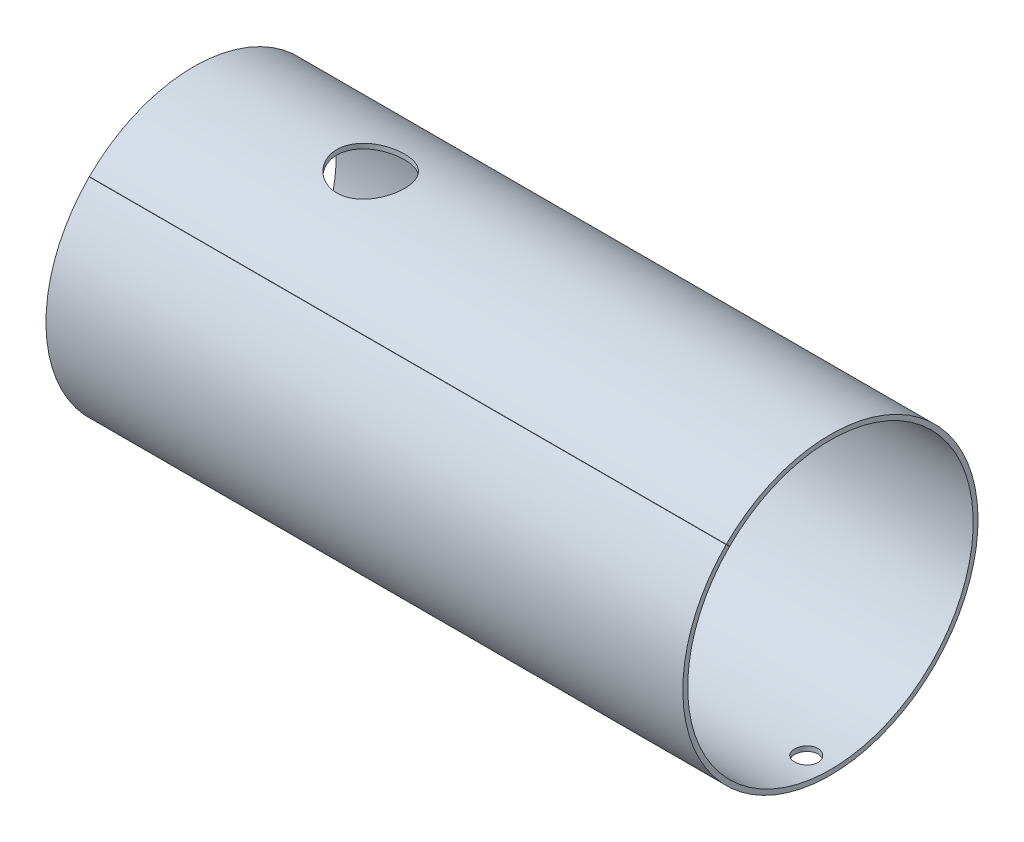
ISO-10303-21;
HEADER;
FILE_DESCRIPTION(('STEP AP214'),'2;1');
FILE_NAME('part.step','',(''),(''),'','','');
FILE_SCHEMA(('AUTOMOTIVE_DESIGN { 1 0 10303 214 1 1 1 1 }'));
ENDSEC;
DATA;
#1=APPLICATION_CONTEXT('core data for automotive mechanical design processes');
#2=APPLICATION_PROTOCOL_DEFINITION('international standard','automotive_design',2000,#1);
#3=PRODUCT_CONTEXT('',#1,'mechanical');
#4=PRODUCT('Part','Part','',(#3));
#5=PRODUCT_RELATED_PRODUCT_CATEGORY('part','',(#4));
#6=PRODUCT_DEFINITION_FORMATION('','',#4);
#7=PRODUCT_DEFINITION_CONTEXT('part definition',#1,'design');
#8=PRODUCT_DEFINITION('design','',#6,#7);
#9=PRODUCT_DEFINITION_SHAPE('','',#8);
#10=(LENGTH_UNIT() NAMED_UNIT(*) SI_UNIT(.MILLI.,.METRE.));
#11=(NAMED_UNIT(*) PLANE_ANGLE_UNIT() SI_UNIT($,.RADIAN.));
#12=(NAMED_UNIT(*) SI_UNIT($,.STERADIAN.) SOLID_ANGLE_UNIT());
#13=UNCERTAINTY_MEASURE_WITH_UNIT(LENGTH_MEASURE(1.E-05),#10,'distance_accuracy_value','');
#14=(GEOMETRIC_REPRESENTATION_CONTEXT(3) GLOBAL_UNCERTAINTY_ASSIGNED_CONTEXT((#13)) GLOBAL_UNIT_ASSIGNED_CONTEXT((#10,
#11,#12)) REPRESENTATION_CONTEXT('',''));
#15=CARTESIAN_POINT('',(0.,0.,0.));
#16=DIRECTION('',(0.,0.,1.));
#17=DIRECTION('',(1.,0.,0.));
#18=AXIS2_PLACEMENT_3D('',#15,#16,#17);
#19=CARTESIAN_POINT('',(-766.,0.,0.));
#20=DIRECTION('',(1.,0.,0.));
#21=DIRECTION('',(0.,0.,-1.));
#22=AXIS2_PLACEMENT_3D('',#19,#20,#21);
#23=CYLINDRICAL_SURFACE('',#22,305.);
#24=DIRECTION('',(1.,0.,0.));
#25=VECTOR('',#24,1.);
#26=CARTESIAN_POINT('',(-766.,216.04365050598,215.290829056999));
#27=LINE('',#26,#25);
#28=CARTESIAN_POINT('',(550.,216.04365050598,215.290829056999));
#29=VERTEX_POINT('',#28);
#30=CARTESIAN_POINT('',(-766.,216.04365050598,215.290829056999));
#31=VERTEX_POINT('',#30);
#32=EDGE_CURVE('E160',#29,#31,#27,.F.);
#33=ORIENTED_EDGE('',*,*,#32,.F.);
#34=CARTESIAN_POINT('',(550.,0.,0.));
#35=DIRECTION('',(1.,0.,0.));
#36=DIRECTION('',(0.,0.,-1.));
#37=AXIS2_PLACEMENT_3D('',#34,#35,#36);
#38=CIRCLE('',#37,305.);
#39=CARTESIAN_POINT('',(550.,215.667568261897,215.667568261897));
#40=VERTEX_POINT('',#39);
#41=EDGE_CURVE('E112',#40,#29,#38,.T.);
#42=ORIENTED_EDGE('',*,*,#41,.F.);
#43=DIRECTION('',(1.,0.,0.));
#44=VECTOR('',#43,1.);
#45=CARTESIAN_POINT('',(-766.,215.667568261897,215.667568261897));
#46=LINE('',#45,#44);
#47=CARTESIAN_POINT('',(-766.,215.667568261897,215.667568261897));
#48=VERTEX_POINT('',#47);
#49=EDGE_CURVE('E77',#48,#40,#46,.T.);
#50=ORIENTED_EDGE('',*,*,#49,.F.);
#51=CARTESIAN_POINT('',(-766.,0.,0.));
#52=DIRECTION('',(1.,0.,0.));
#53=DIRECTION('',(0.,0.,-1.));
#54=AXIS2_PLACEMENT_3D('',#51,#52,#53);
#55=CIRCLE('',#54,305.);
#56=EDGE_CURVE('E100',#48,#31,#55,.T.);
#57=ORIENTED_EDGE('',*,*,#56,.T.);
#58=EDGE_LOOP('',(#33,#42,#50,#57));
#59=FACE_BOUND('',#58,.T.);
#60=CARTESIAN_POINT('',(500.,-304.042394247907,24.15));
#61=CARTESIAN_POINT('',(499.32264232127,-304.042392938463,24.1500059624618));
#62=CARTESIAN_POINT('',(498.645378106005,-304.044662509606,24.1214911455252));
#63=CARTESIAN_POINT('',(497.295453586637,-304.053673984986,24.0076388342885));
#64=CARTESIAN_POINT('',(496.622794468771,-304.060417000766,23.9222872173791));
#65=CARTESIAN_POINT('',(495.286399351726,-304.078194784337,23.6952395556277));
#66=CARTESIAN_POINT('',(494.622673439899,-304.089234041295,23.5534845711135));
#67=CARTESIAN_POINT('',(493.309612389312,-304.115287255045,23.2146699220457));
#68=CARTESIAN_POINT('',(492.660276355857,-304.13030096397,23.0176137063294));
#69=CARTESIAN_POINT('',(491.3809090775,-304.163866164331,22.5697336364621));
#70=CARTESIAN_POINT('',(490.750867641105,-304.182415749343,22.3189387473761));
#71=CARTESIAN_POINT('',(489.514167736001,-304.222530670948,21.7653120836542));
#72=CARTESIAN_POINT('',(488.907509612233,-304.244096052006,21.4624795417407));
#73=CARTESIAN_POINT('',(487.721997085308,-304.289625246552,20.807013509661));
#74=CARTESIAN_POINT('',(487.143136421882,-304.313588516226,20.4543913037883));
#75=CARTESIAN_POINT('',(486.017142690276,-304.363239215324,19.7017960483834));
#76=CARTESIAN_POINT('',(485.470009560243,-304.388926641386,19.3018230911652));
#77=CARTESIAN_POINT('',(484.410215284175,-304.441354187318,18.4564759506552));
#78=CARTESIAN_POINT('',(483.897627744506,-304.468096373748,18.0110096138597));
#79=CARTESIAN_POINT('',(482.911779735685,-304.521825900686,17.0785125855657));
#80=CARTESIAN_POINT('',(482.438519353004,-304.548813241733,16.5914818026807));
#81=CARTESIAN_POINT('',(481.534646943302,-304.602270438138,15.5792697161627));
#82=CARTESIAN_POINT('',(481.104036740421,-304.628740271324,15.0540867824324));
#83=CARTESIAN_POINT('',(480.288534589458,-304.680412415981,13.9692908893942));
#84=CARTESIAN_POINT('',(479.903642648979,-304.705614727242,13.4096779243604));
#85=CARTESIAN_POINT('',(479.181838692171,-304.754070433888,12.2592169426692));
#86=CARTESIAN_POINT('',(478.844990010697,-304.777321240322,11.6683290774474));
#87=CARTESIAN_POINT('',(478.222280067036,-304.821177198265,10.4601751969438));
#88=CARTESIAN_POINT('',(477.936418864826,-304.841782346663,9.842909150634));
#89=CARTESIAN_POINT('',(477.417742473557,-304.87976140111,8.58639062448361));
#90=CARTESIAN_POINT('',(477.18492660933,-304.897135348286,7.94713842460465));
#91=CARTESIAN_POINT('',(476.774018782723,-304.928158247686,6.65119334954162));
#92=CARTESIAN_POINT('',(476.595926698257,-304.941807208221,5.99450051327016));
#93=CARTESIAN_POINT('',(476.296075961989,-304.964967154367,4.66976639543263));
#94=CARTESIAN_POINT('',(476.17419898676,-304.974486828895,4.00175204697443));
#95=CARTESIAN_POINT('',(475.987108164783,-304.989160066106,2.65778746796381));
#96=CARTESIAN_POINT('',(475.921894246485,-304.994313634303,1.98183724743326));
#97=CARTESIAN_POINT('',(475.848604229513,-305.000108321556,0.626837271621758));
#98=CARTESIAN_POINT('',(475.840527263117,-305.00074950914,-0.0522124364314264));
#99=CARTESIAN_POINT('',(475.881567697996,-304.997501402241,-1.40856990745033));
#100=CARTESIAN_POINT('',(475.930685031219,-304.993612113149,-2.08587767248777));
#101=CARTESIAN_POINT('',(476.085582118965,-304.98142722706,-3.43239960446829));
#102=CARTESIAN_POINT('',(476.191234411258,-304.973141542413,-4.10162852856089));
#103=CARTESIAN_POINT('',(476.458356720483,-304.952404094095,-5.42878489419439));
#104=CARTESIAN_POINT('',(476.619826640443,-304.939952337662,-6.08671235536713));
#105=CARTESIAN_POINT('',(476.997422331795,-304.911234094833,-7.3866096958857));
#106=CARTESIAN_POINT('',(477.213548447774,-304.894967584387,-8.0285794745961));
#107=CARTESIAN_POINT('',(477.698906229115,-304.859078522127,-9.2920226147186));
#108=CARTESIAN_POINT('',(477.968137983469,-304.839455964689,-9.91349594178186));
#109=CARTESIAN_POINT('',(478.558114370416,-304.79738407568,-11.1322462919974));
#110=CARTESIAN_POINT('',(478.878916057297,-304.774931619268,-11.729495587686));
#111=CARTESIAN_POINT('',(479.569534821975,-304.72785035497,-12.8948575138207));
#112=CARTESIAN_POINT('',(479.939351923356,-304.703221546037,-13.4629701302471));
#113=CARTESIAN_POINT('',(480.72538838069,-304.652481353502,-14.5660745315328));
#114=CARTESIAN_POINT('',(481.141608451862,-304.626369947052,-15.1010658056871));
#115=CARTESIAN_POINT('',(482.017510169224,-304.573400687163,-16.1341620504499));
#116=CARTESIAN_POINT('',(482.477191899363,-304.546542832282,-16.6322669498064));
#117=CARTESIAN_POINT('',(483.438102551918,-304.492763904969,-17.5894052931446));
#118=CARTESIAN_POINT('',(483.939442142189,-304.465842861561,-18.0483276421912));
#119=CARTESIAN_POINT('',(484.979030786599,-304.412775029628,-18.9223184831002));
#120=CARTESIAN_POINT('',(485.517279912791,-304.386628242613,-19.3373868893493));
#121=CARTESIAN_POINT('',(486.626888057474,-304.33585152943,-20.1207253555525));
#122=CARTESIAN_POINT('',(487.198247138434,-304.311221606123,-20.4889953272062));
#123=CARTESIAN_POINT('',(488.370035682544,-304.264179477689,-21.1761123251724));
#124=CARTESIAN_POINT('',(488.970465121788,-304.241767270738,-21.4949593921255));
#125=CARTESIAN_POINT('',(490.196210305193,-304.199797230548,-22.0809810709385));
#126=CARTESIAN_POINT('',(490.821528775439,-304.180239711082,-22.348150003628));
#127=CARTESIAN_POINT('',(492.092549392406,-304.144540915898,-22.828849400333));
#128=CARTESIAN_POINT('',(492.738251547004,-304.1283996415,-23.0423798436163));
#129=CARTESIAN_POINT('',(494.045429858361,-304.099995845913,-23.4142550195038));
#130=CARTESIAN_POINT('',(494.70690577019,-304.08773326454,-23.5726006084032));
#131=CARTESIAN_POINT('',(496.040916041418,-304.067438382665,-23.8329602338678));
#132=CARTESIAN_POINT('',(496.713450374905,-304.059406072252,-23.9349744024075));
#133=CARTESIAN_POINT('',(498.06292867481,-304.047818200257,-24.0817288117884));
#134=CARTESIAN_POINT('',(498.739855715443,-304.044250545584,-24.1266237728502));
#135=CARTESIAN_POINT('',(500.095095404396,-304.041654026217,-24.1593230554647));
#136=CARTESIAN_POINT('',(500.773408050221,-304.042625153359,-24.1471274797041));
#137=CARTESIAN_POINT('',(502.126577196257,-304.049078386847,-24.065734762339));
#138=CARTESIAN_POINT('',(502.801433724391,-304.054560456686,-23.9965380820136));
#139=CARTESIAN_POINT('',(504.142888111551,-304.069878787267,-23.8016459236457));
#140=CARTESIAN_POINT('',(504.809485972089,-304.07971504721,-23.67595045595));
#141=CARTESIAN_POINT('',(506.12882317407,-304.103445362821,-23.3691703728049));
#142=CARTESIAN_POINT('',(506.781579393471,-304.117334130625,-23.1881579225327));
#143=CARTESIAN_POINT('',(508.069505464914,-304.148779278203,-22.7719908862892));
#144=CARTESIAN_POINT('',(508.704675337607,-304.166335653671,-22.5368363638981));
#145=CARTESIAN_POINT('',(509.952954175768,-304.204617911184,-22.0140655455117));
#146=CARTESIAN_POINT('',(510.566062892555,-304.225343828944,-21.7264486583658));
#147=CARTESIAN_POINT('',(511.765898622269,-304.269378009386,-21.1008031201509));
#148=CARTESIAN_POINT('',(512.35262557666,-304.292686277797,-20.7627743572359));
#149=CARTESIAN_POINT('',(513.496805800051,-304.3412785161,-20.0379229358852));
#150=CARTESIAN_POINT('',(514.05419353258,-304.366566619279,-19.6509971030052));
#151=CARTESIAN_POINT('',(515.134413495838,-304.418358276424,-18.8316641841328));
#152=CARTESIAN_POINT('',(515.657245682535,-304.444861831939,-18.3992570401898));
#153=CARTESIAN_POINT('',(516.664683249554,-304.498335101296,-17.4920080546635));
#154=CARTESIAN_POINT('',(517.14928810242,-304.525304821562,-17.0171656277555));
#155=CARTESIAN_POINT('',(518.07685124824,-304.578948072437,-16.0283954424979));
#156=CARTESIAN_POINT('',(518.519809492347,-304.605621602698,-15.5144676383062));
#157=CARTESIAN_POINT('',(519.361898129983,-304.657977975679,-14.4499484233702));
#158=CARTESIAN_POINT('',(519.760927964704,-304.683658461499,-13.8992773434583));
#159=CARTESIAN_POINT('',(520.511176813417,-304.733236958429,-12.7661980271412));
#160=CARTESIAN_POINT('',(520.862395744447,-304.757134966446,-12.183789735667));
#161=CARTESIAN_POINT('',(521.514511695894,-304.802470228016,-10.991363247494));
#162=CARTESIAN_POINT('',(521.815409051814,-304.823907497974,-10.3813452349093));
#163=CARTESIAN_POINT('',(522.364724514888,-304.863712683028,-9.13802458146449));
#164=CARTESIAN_POINT('',(522.613142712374,-304.882080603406,-8.50472198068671));
#165=CARTESIAN_POINT('',(523.05545399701,-304.915205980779,-7.22007611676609));
#166=CARTESIAN_POINT('',(523.249409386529,-304.929967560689,-6.56875441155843));
#167=CARTESIAN_POINT('',(523.581771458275,-304.955488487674,-5.2520112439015));
#168=CARTESIAN_POINT('',(523.720178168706,-304.96624783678,-4.58658978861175));
#169=CARTESIAN_POINT('',(523.940436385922,-304.983458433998,-3.24640582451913));
#170=CARTESIAN_POINT('',(524.022288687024,-304.989909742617,-2.57164344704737));
#171=CARTESIAN_POINT('',(524.128845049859,-304.998321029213,-1.21759392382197));
#172=CARTESIAN_POINT('',(524.153549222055,-305.00028101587,-0.538306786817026));
#173=CARTESIAN_POINT('',(524.145640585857,-304.999654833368,0.818069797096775));
#174=CARTESIAN_POINT('',(524.113184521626,-304.99708109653,1.49516016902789));
#175=CARTESIAN_POINT('',(523.991493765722,-304.987484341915,2.84418619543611));
#176=CARTESIAN_POINT('',(523.902259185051,-304.980461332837,3.51612185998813));
#177=CARTESIAN_POINT('',(523.66765744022,-304.962164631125,4.85006199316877));
#178=CARTESIAN_POINT('',(523.522290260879,-304.950890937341,5.51206645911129));
#179=CARTESIAN_POINT('',(523.17647242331,-304.924411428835,6.82144738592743));
#180=CARTESIAN_POINT('',(522.97602171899,-304.909205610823,7.46882383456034));
#181=CARTESIAN_POINT('',(522.521488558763,-304.875291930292,8.74433620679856));
#182=CARTESIAN_POINT('',(522.267408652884,-304.85658423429,9.37247304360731));
#183=CARTESIAN_POINT('',(521.707428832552,-304.816193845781,10.6051060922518));
#184=CARTESIAN_POINT('',(521.401528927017,-304.794511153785,11.2096023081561));
#185=CARTESIAN_POINT('',(520.740092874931,-304.748782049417,12.3906881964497));
#186=CARTESIAN_POINT('',(520.384557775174,-304.724735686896,12.9672784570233));
#187=CARTESIAN_POINT('',(519.626364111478,-304.674955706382,14.0885181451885));
#188=CARTESIAN_POINT('',(519.223705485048,-304.64922208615,14.6331675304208));
#189=CARTESIAN_POINT('',(518.372996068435,-304.596723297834,15.6880797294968));
#190=CARTESIAN_POINT('',(517.924829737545,-304.569955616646,16.1982492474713));
#191=CARTESIAN_POINT('',(516.987146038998,-304.516209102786,17.1790476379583));
#192=CARTESIAN_POINT('',(516.497628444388,-304.489230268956,17.649676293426));
#193=CARTESIAN_POINT('',(515.48056921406,-304.435818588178,18.5481810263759));
#194=CARTESIAN_POINT('',(514.953018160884,-304.409385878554,18.9760464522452));
#195=CARTESIAN_POINT('',(513.863728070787,-304.357823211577,19.7858567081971));
#196=CARTESIAN_POINT('',(513.301989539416,-304.332693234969,20.1678022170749));
#197=CARTESIAN_POINT('',(512.14729102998,-304.284407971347,20.8836791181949));
#198=CARTESIAN_POINT('',(511.554279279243,-304.261256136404,21.2175272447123));
#199=CARTESIAN_POINT('',(510.342089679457,-304.217635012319,21.8340583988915));
#200=CARTESIAN_POINT('',(509.722910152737,-304.197165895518,22.1167381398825));
#201=CARTESIAN_POINT('',(508.463476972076,-304.159517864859,22.6286004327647));
#202=CARTESIAN_POINT('',(507.823246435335,-304.142335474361,22.8578395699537));
#203=CARTESIAN_POINT('',(506.525869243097,-304.111729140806,23.2614934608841));
#204=CARTESIAN_POINT('',(505.8687268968,-304.098304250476,23.4359220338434));
#205=CARTESIAN_POINT('',(504.351596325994,-304.072337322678,23.7707806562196));
#206=CARTESIAN_POINT('',(503.48747107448,-304.061152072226,23.9128573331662));
#207=CARTESIAN_POINT('',(501.748845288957,-304.046181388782,24.1024630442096));
#208=CARTESIAN_POINT('',(500.874344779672,-304.042395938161,24.1499923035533));
#209=CARTESIAN_POINT('',(500.,-304.042394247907,24.15));
#210=B_SPLINE_CURVE_WITH_KNOTS('',3,(#60,#61,#62,#63,#64,#65,#66,#67,#68,#69,#70,#71,#72,#73,
#74,#75,#76,#77,#78,#79,#80,#81,#82,#83,#84,#85,#86,#87,#88,#89,#90,#91,#92,#93,#94,#95,#96,#97,
#98,#99,#100,#101,#102,#103,#104,#105,#106,#107,#108,#109,#110,#111,#112,#113,#114,#115,#116,
#117,#118,#119,#120,#121,#122,#123,#124,#125,#126,#127,#128,#129,#130,#131,#132,#133,#134,#135,
#136,#137,#138,#139,#140,#141,#142,#143,#144,#145,#146,#147,#148,#149,#150,#151,#152,#153,#154,
#155,#156,#157,#158,#159,#160,#161,#162,#163,#164,#165,#166,#167,#168,#169,#170,#171,#172,#173,
#174,#175,#176,#177,#178,#179,#180,#181,#182,#183,#184,#185,#186,#187,#188,#189,#190,#191,#192,
#193,#194,#195,#196,#197,#198,#199,#200,#201,#202,#203,#204,#205,#206,#207,#208,#209),
.UNSPECIFIED.,.T.,.F.,(4,2,2,2,2,2,2,2,2,2,2,2,2,2,2,2,2,2,2,2,2,2,2,2,2,2,2,2,2,2,2,2,2,2,2,2,
2,2,2,2,2,2,2,2,2,2,2,2,2,2,2,2,2,2,2,2,2,2,2,2,2,2,2,2,2,2,2,2,2,2,2,2,2,2,4),(0.,
2.03130873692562,4.0631223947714,6.0970648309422,8.13088044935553,10.1636025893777,
12.1963547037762,14.2286468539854,16.260935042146,18.2974248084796,20.3339190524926,
22.3705003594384,24.4070820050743,26.4463241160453,28.4855686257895,30.5247871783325,
32.5640011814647,34.5989031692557,36.6338025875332,38.6686711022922,40.7035371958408,
42.7338347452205,44.7641287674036,46.7944355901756,48.8247458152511,50.8573179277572,
52.8898910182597,54.9224954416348,56.9551037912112,58.993296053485,61.0314922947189,
63.0696923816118,65.107890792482,67.1463130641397,69.1847361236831,71.223127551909,
73.2615142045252,75.2943675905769,77.3272173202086,79.3600505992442,81.3928835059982,
83.4230756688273,85.4532654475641,87.4834781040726,89.5136952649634,91.548270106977,
93.5828475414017,95.6174530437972,97.6520609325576,99.6912335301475,101.730409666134,
103.769572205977,105.808731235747,107.845547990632,109.882363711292,111.919150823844,
113.955933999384,115.987140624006,118.018343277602,120.049546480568,122.080751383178,
124.111859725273,126.142967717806,128.174032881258,130.205100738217,132.24146077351,
134.277831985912,136.314709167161,138.351556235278,140.391888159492,142.432351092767,
144.470643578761,146.508421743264,149.130475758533,151.752523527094),.UNSPECIFIED.);
#211=CARTESIAN_POINT('',(500.,-304.042394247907,24.15));
#212=VERTEX_POINT('',#211);
#213=EDGE_CURVE('E113',#212,#212,#210,.T.);
#214=ORIENTED_EDGE('',*,*,#213,.F.);
#215=EDGE_LOOP('',(#214));
#216=FACE_BOUND('',#215,.T.);
#217=CARTESIAN_POINT('',(-400.,296.893882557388,-69.8500000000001));
#218=CARTESIAN_POINT('',(-398.065858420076,296.893887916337,-69.8499905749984));
#219=CARTESIAN_POINT('',(-396.131518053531,296.91283424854,-69.7695969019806));
#220=CARTESIAN_POINT('',(-392.276746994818,296.988065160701,-69.4486550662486));
#221=CARTESIAN_POINT('',(-390.356318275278,297.044354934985,-69.2080846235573));
#222=CARTESIAN_POINT('',(-386.542190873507,297.192625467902,-68.5685865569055));
#223=CARTESIAN_POINT('',(-384.648509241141,297.284628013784,-68.1695622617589));
#224=CARTESIAN_POINT('',(-380.9026157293,297.501581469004,-67.2164230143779));
#225=CARTESIAN_POINT('',(-379.050402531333,297.62653132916,-66.6623130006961));
#226=CARTESIAN_POINT('',(-375.402363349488,297.905550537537,-65.4041076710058));
#227=CARTESIAN_POINT('',(-373.60647403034,298.059585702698,-64.7001882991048));
#228=CARTESIAN_POINT('',(-370.080939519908,298.392438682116,-63.1473091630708));
#229=CARTESIAN_POINT('',(-368.351294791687,298.571256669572,-62.2983483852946));
#230=CARTESIAN_POINT('',(-364.969713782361,298.948615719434,-60.4615884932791));
#231=CARTESIAN_POINT('',(-363.317775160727,299.147156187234,-59.473793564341));
#232=CARTESIAN_POINT('',(-360.102218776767,299.558453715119,-57.3662366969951));
#233=CARTESIAN_POINT('',(-358.538602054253,299.771210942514,-56.2464732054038));
#234=CARTESIAN_POINT('',(-355.48446579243,300.208740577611,-53.8628277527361));
#235=CARTESIAN_POINT('',(-353.995596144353,300.433654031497,-52.5968571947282));
#236=CARTESIAN_POINT('',(-351.129301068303,300.885890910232,-49.944865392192));
#237=CARTESIAN_POINT('',(-349.75187683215,301.113214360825,-48.5588428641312));
#238=CARTESIAN_POINT('',(-347.117551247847,301.564000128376,-45.6758383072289));
#239=CARTESIAN_POINT('',(-345.860659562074,301.787462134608,-44.1788473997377));
#240=CARTESIAN_POINT('',(-343.476080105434,302.224348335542,-41.0838807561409));
#241=CARTESIAN_POINT('',(-342.348392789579,302.437772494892,-39.4859046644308));
#242=CARTESIAN_POINT('',(-340.217821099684,302.851087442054,-36.1804444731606));
#243=CARTESIAN_POINT('',(-339.216538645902,303.050792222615,-34.4719039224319));
#244=CARTESIAN_POINT('',(-337.361752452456,303.428249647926,-30.9740414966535));
#245=CARTESIAN_POINT('',(-336.508250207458,303.606002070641,-29.1847188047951));
#246=CARTESIAN_POINT('',(-334.955725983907,303.934465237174,-25.5380423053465));
#247=CARTESIAN_POINT('',(-334.256689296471,304.085178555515,-23.6806949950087));
#248=CARTESIAN_POINT('',(-333.018643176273,304.355243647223,-19.9111922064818));
#249=CARTESIAN_POINT('',(-332.479630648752,304.474596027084,-17.9990377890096));
#250=CARTESIAN_POINT('',(-331.573945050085,304.676731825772,-14.1671070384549));
#251=CARTESIAN_POINT('',(-331.204479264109,304.760106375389,-12.2480217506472));
#252=CARTESIAN_POINT('',(-330.627537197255,304.890860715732,-8.38443629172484));
#253=CARTESIAN_POINT('',(-330.420059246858,304.938240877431,-6.43993638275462));
#254=CARTESIAN_POINT('',(-330.168858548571,304.995657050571,-2.54005017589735));
#255=CARTESIAN_POINT('',(-330.125117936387,305.00569713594,-0.584665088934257));
#256=CARTESIAN_POINT('',(-330.201716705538,304.98815785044,3.32270797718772));
#257=CARTESIAN_POINT('',(-330.322054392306,304.960578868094,5.27469599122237));
#258=CARTESIAN_POINT('',(-330.722003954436,304.869449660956,9.12452630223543));
#259=CARTESIAN_POINT('',(-330.998599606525,304.806580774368,11.0226990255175));
#260=CARTESIAN_POINT('',(-331.706560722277,304.647095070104,14.7884807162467));
#261=CARTESIAN_POINT('',(-332.137923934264,304.550478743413,16.6560901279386));
#262=CARTESIAN_POINT('',(-333.152027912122,304.326115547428,20.347868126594));
#263=CARTESIAN_POINT('',(-333.734773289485,304.198367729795,22.1720353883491));
#264=CARTESIAN_POINT('',(-335.047173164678,303.915180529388,25.7645104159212));
#265=CARTESIAN_POINT('',(-335.776829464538,303.759740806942,27.5328174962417));
#266=CARTESIAN_POINT('',(-337.383957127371,303.424000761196,31.0154887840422));
#267=CARTESIAN_POINT('',(-338.262546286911,303.243514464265,32.7293191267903));
#268=CARTESIAN_POINT('',(-340.157124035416,302.863478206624,36.077028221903));
#269=CARTESIAN_POINT('',(-341.173113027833,302.663928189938,37.7109067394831));
#270=CARTESIAN_POINT('',(-343.335562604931,302.25107080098,40.8883553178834));
#271=CARTESIAN_POINT('',(-344.482039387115,302.037761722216,42.4319141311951));
#272=CARTESIAN_POINT('',(-346.897667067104,301.60309025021,45.4186512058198));
#273=CARTESIAN_POINT('',(-348.166819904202,301.381727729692,46.8618278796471));
#274=CARTESIAN_POINT('',(-350.849774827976,300.931776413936,49.6702588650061));
#275=CARTESIAN_POINT('',(-352.266215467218,300.703137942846,51.0329858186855));
#276=CARTESIAN_POINT('',(-355.209254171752,300.250020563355,53.6345893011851));
#277=CARTESIAN_POINT('',(-356.735853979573,300.025541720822,54.8734638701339));
#278=CARTESIAN_POINT('',(-359.889083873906,299.587092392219,57.2188597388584));
#279=CARTESIAN_POINT('',(-361.515717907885,299.373122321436,58.3253758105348));
#280=CARTESIAN_POINT('',(-364.858052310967,298.961843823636,60.3981192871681));
#281=CARTESIAN_POINT('',(-366.573752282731,298.764535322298,61.3643473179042));
#282=CARTESIAN_POINT('',(-370.088774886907,298.391679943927,63.152537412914));
#283=CARTESIAN_POINT('',(-371.888371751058,298.216212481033,63.9739772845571));
#284=CARTESIAN_POINT('',(-375.552943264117,297.893110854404,65.4620093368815));
#285=CARTESIAN_POINT('',(-377.417918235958,297.745476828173,66.1286007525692));
#286=CARTESIAN_POINT('',(-381.199575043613,297.482565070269,67.3014488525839));
#287=CARTESIAN_POINT('',(-383.11624939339,297.367282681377,67.8077286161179));
#288=CARTESIAN_POINT('',(-386.987431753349,297.172623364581,68.65582006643));
#289=CARTESIAN_POINT('',(-388.941938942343,297.093245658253,68.9976353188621));
#290=CARTESIAN_POINT('',(-392.830218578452,296.974227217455,69.5080963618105));
#291=CARTESIAN_POINT('',(-394.763481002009,296.933739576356,69.6804349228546));
#292=CARTESIAN_POINT('',(-398.638052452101,296.890687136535,69.8636449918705));
#293=CARTESIAN_POINT('',(-400.579361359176,296.888121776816,69.8745188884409));
#294=CARTESIAN_POINT('',(-404.455683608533,296.92099037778,69.7347154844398));
#295=CARTESIAN_POINT('',(-406.390697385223,296.956421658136,69.58404957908));
#296=CARTESIAN_POINT('',(-410.240461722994,297.064205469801,69.122455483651));
#297=CARTESIAN_POINT('',(-412.155212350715,297.136557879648,68.8115278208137));
#298=CARTESIAN_POINT('',(-415.92549770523,297.314815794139,68.0371637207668));
#299=CARTESIAN_POINT('',(-417.781480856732,297.420264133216,67.5758020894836));
#300=CARTESIAN_POINT('',(-421.447518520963,297.661935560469,66.5031880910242));
#301=CARTESIAN_POINT('',(-423.257573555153,297.798158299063,65.891937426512));
#302=CARTESIAN_POINT('',(-426.81975756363,298.097511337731,64.5241310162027));
#303=CARTESIAN_POINT('',(-428.571882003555,298.260643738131,63.7675639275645));
#304=CARTESIAN_POINT('',(-432.006604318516,298.609244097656,62.11467070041));
#305=CARTESIAN_POINT('',(-433.689200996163,298.794712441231,61.2183421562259));
#306=CARTESIAN_POINT('',(-437.001591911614,299.186137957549,59.2760677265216));
#307=CARTESIAN_POINT('',(-438.63003025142,299.392386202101,58.2278679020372));
#308=CARTESIAN_POINT('',(-441.793264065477,299.816939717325,56.0007788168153));
#309=CARTESIAN_POINT('',(-443.328058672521,300.035245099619,54.821888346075));
#310=CARTESIAN_POINT('',(-446.294260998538,300.477927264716,52.3412107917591));
#311=CARTESIAN_POINT('',(-447.725656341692,300.702304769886,51.0394090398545));
#312=CARTESIAN_POINT('',(-450.475583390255,301.15099420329,48.321581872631));
#313=CARTESIAN_POINT('',(-451.794113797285,301.375306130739,46.9055551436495));
#314=CARTESIAN_POINT('',(-454.335617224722,301.822363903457,43.9381115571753));
#315=CARTESIAN_POINT('',(-455.556055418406,302.044981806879,42.3845030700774));
#316=CARTESIAN_POINT('',(-457.8617444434,302.47756312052,39.1783112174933));
#317=CARTESIAN_POINT('',(-458.946993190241,302.687526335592,37.5257263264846));
#318=CARTESIAN_POINT('',(-460.974374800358,303.088871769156,34.1328774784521));
#319=CARTESIAN_POINT('',(-461.916512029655,303.280254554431,32.3926161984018));
#320=CARTESIAN_POINT('',(-463.650582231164,303.639019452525,28.8364197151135));
#321=CARTESIAN_POINT('',(-464.442517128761,303.806401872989,27.0204854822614));
#322=CARTESIAN_POINT('',(-465.865137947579,304.111351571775,23.3382794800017));
#323=CARTESIAN_POINT('',(-466.496878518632,304.249112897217,21.4724313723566));
#324=CARTESIAN_POINT('',(-467.600964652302,304.492327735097,17.692073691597));
#325=CARTESIAN_POINT('',(-468.073310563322,304.597781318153,15.7775642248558));
#326=CARTESIAN_POINT('',(-468.85462299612,304.773344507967,11.9141495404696));
#327=CARTESIAN_POINT('',(-469.16361137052,304.843458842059,9.96524895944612));
#328=CARTESIAN_POINT('',(-469.615664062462,304.946338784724,6.04733079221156));
#329=CARTESIAN_POINT('',(-469.758731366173,304.97910506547,4.07831356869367));
#330=CARTESIAN_POINT('',(-469.87636240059,305.006033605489,0.179925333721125));
#331=CARTESIAN_POINT('',(-469.854689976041,305.001058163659,-1.74932717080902));
#332=CARTESIAN_POINT('',(-469.651913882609,304.954680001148,-5.5989705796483));
#333=CARTESIAN_POINT('',(-469.470812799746,304.913277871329,-7.51936162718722));
#334=CARTESIAN_POINT('',(-468.950681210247,304.795193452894,-11.3374672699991));
#335=CARTESIAN_POINT('',(-468.611654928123,304.718512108,-13.2351824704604));
#336=CARTESIAN_POINT('',(-467.778420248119,304.531980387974,-16.9945610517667));
#337=CARTESIAN_POINT('',(-467.284211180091,304.422129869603,-18.8562242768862));
#338=CARTESIAN_POINT('',(-466.146723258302,304.172747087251,-22.5234300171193));
#339=CARTESIAN_POINT('',(-465.504028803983,304.033331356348,-24.3291618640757));
#340=CARTESIAN_POINT('',(-464.073408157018,303.728317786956,-27.8798204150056));
#341=CARTESIAN_POINT('',(-463.285482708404,303.562720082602,-29.6247474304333));
#342=CARTESIAN_POINT('',(-461.570080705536,303.209742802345,-33.0424551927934));
#343=CARTESIAN_POINT('',(-460.642592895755,303.022361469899,-34.7152301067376));
#344=CARTESIAN_POINT('',(-458.654619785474,302.630785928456,-37.9777203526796));
#345=CARTESIAN_POINT('',(-457.594132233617,302.426591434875,-39.5674342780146));
#346=CARTESIAN_POINT('',(-455.324178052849,302.002440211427,-42.6855094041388));
#347=CARTESIAN_POINT('',(-454.112092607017,301.782245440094,-44.2119322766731));
#348=CARTESIAN_POINT('',(-451.565127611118,301.335972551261,-47.1577296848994));
#349=CARTESIAN_POINT('',(-450.230246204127,301.10989434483,-48.5771026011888));
#350=CARTESIAN_POINT('',(-447.446255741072,300.658008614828,-51.2997764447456));
#351=CARTESIAN_POINT('',(-445.997119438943,300.432201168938,-52.6030495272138));
#352=CARTESIAN_POINT('',(-442.994439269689,299.98715854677,-55.0844264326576));
#353=CARTESIAN_POINT('',(-441.440895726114,299.767923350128,-56.262530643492));
#354=CARTESIAN_POINT('',(-438.215557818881,299.338961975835,-58.5021863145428));
#355=CARTESIAN_POINT('',(-436.542339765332,299.129427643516,-59.5617255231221));
#356=CARTESIAN_POINT('',(-433.110139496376,298.729567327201,-61.5358472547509));
#357=CARTESIAN_POINT('',(-431.351152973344,298.539242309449,-62.450422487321));
#358=CARTESIAN_POINT('',(-427.761046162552,298.183609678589,-64.126976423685));
#359=CARTESIAN_POINT('',(-425.929979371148,298.018283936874,-64.8890658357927));
#360=CARTESIAN_POINT('',(-422.207666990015,297.717515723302,-66.2553469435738));
#361=CARTESIAN_POINT('',(-420.31643175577,297.582068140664,-66.8595656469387));
#362=CARTESIAN_POINT('',(-416.906637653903,297.371117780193,-67.7907999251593));
#363=CARTESIAN_POINT('',(-415.397063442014,297.288983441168,-68.1495411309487));
#364=CARTESIAN_POINT('',(-412.356538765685,297.14702861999,-68.7658618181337));
#365=CARTESIAN_POINT('',(-410.82559175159,297.08720457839,-69.0234574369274));
#366=CARTESIAN_POINT('',(-407.749284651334,296.991019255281,-69.4361538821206));
#367=CARTESIAN_POINT('',(-406.203925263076,296.954656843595,-69.5912596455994));
#368=CARTESIAN_POINT('',(-403.105754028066,296.906084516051,-69.7981943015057));
#369=CARTESIAN_POINT('',(-401.552941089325,296.893878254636,-69.8500075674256));
#370=CARTESIAN_POINT('',(-400.,296.893882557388,-69.8500000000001));
#371=B_SPLINE_CURVE_WITH_KNOTS('',3,(#217,#218,#219,#220,#221,#222,#223,#224,#225,#226,#227,
#228,#229,#230,#231,#232,#233,#234,#235,#236,#237,#238,#239,#240,#241,#242,#243,#244,#245,#246,
#247,#248,#249,#250,#251,#252,#253,#254,#255,#256,#257,#258,#259,#260,#261,#262,#263,#264,#265,
#266,#267,#268,#269,#270,#271,#272,#273,#274,#275,#276,#277,#278,#279,#280,#281,#282,#283,#284,
#285,#286,#287,#288,#289,#290,#291,#292,#293,#294,#295,#296,#297,#298,#299,#300,#301,#302,#303,
#304,#305,#306,#307,#308,#309,#310,#311,#312,#313,#314,#315,#316,#317,#318,#319,#320,#321,#322,
#323,#324,#325,#326,#327,#328,#329,#330,#331,#332,#333,#334,#335,#336,#337,#338,#339,#340,#341,
#342,#343,#344,#345,#346,#347,#348,#349,#350,#351,#352,#353,#354,#355,#356,#357,#358,#359,#360,
#361,#362,#363,#364,#365,#366,#367,#368,#369,#370),.UNSPECIFIED.,.T.,.F.,(4,2,2,2,2,2,2,2,2,2,2,
2,2,2,2,2,2,2,2,2,2,2,2,2,2,2,2,2,2,2,2,2,2,2,2,2,2,2,2,2,2,2,2,2,2,2,2,2,2,2,2,2,2,2,2,2,2,2,2,
2,2,2,2,2,2,2,2,2,2,2,2,2,2,2,2,2,4),(0.,5.80101200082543,11.6028310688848,17.4081952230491,
23.2133745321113,29.0117731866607,34.810212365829,40.6084767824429,46.4068094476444,
52.3016543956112,58.1965623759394,64.0919425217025,69.9873434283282,75.9512272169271,
81.9151713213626,87.8785472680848,93.8418078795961,99.7029679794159,105.564067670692,
111.424527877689,117.284927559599,123.035891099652,128.786770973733,134.537826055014,
140.288951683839,146.085325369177,151.881716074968,157.678827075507,163.476029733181,
169.405429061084,175.334922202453,181.264649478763,187.194350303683,193.145018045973,
199.095715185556,205.045555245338,210.995266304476,216.812258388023,222.629164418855,
228.445660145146,234.262136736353,240.001563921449,245.740925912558,251.480736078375,
257.220645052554,263.056665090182,268.892739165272,274.7295106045,280.566349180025,
286.523691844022,292.481126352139,298.438379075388,304.395555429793,310.312429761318,
316.229291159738,322.145360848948,328.061324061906,333.842537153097,339.623656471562,
345.404621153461,351.185610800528,356.944224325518,362.702808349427,368.461857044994,
374.221003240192,380.098781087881,385.976647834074,391.855920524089,397.735174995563,
403.702575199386,409.670275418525,415.633627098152,421.595957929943,426.253910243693,
430.911119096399,435.568103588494,440.225792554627),.UNSPECIFIED.);
#372=CARTESIAN_POINT('',(-400.,296.893882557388,-69.8500000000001));
#373=VERTEX_POINT('',#372);
#374=EDGE_CURVE('E132',#373,#373,#371,.T.);
#375=ORIENTED_EDGE('',*,*,#374,.T.);
#376=EDGE_LOOP('',(#375));
#377=FACE_BOUND('',#376,.T.);
#378=ADVANCED_FACE('F55',(#59,#216,#377),#23,.T.);
#379=CARTESIAN_POINT('',(-766.,0.,0.));
#380=DIRECTION('',(1.,0.,0.));
#381=DIRECTION('',(0.,0.,-1.));
#382=AXIS2_PLACEMENT_3D('',#379,#380,#381);
#383=CYLINDRICAL_SURFACE('',#382,295.);
#384=CARTESIAN_POINT('',(550.,0.,0.));
#385=DIRECTION('',(1.,0.,0.));
#386=DIRECTION('',(0.,0.,-1.));
#387=AXIS2_PLACEMENT_3D('',#384,#385,#386);
#388=CIRCLE('',#387,295.);
#389=CARTESIAN_POINT('',(550.,208.596500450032,208.596500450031));
#390=VERTEX_POINT('',#389);
#391=CARTESIAN_POINT('',(550.,208.960252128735,208.232113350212));
#392=VERTEX_POINT('',#391);
#393=EDGE_CURVE('E106',#390,#392,#388,.T.);
#394=ORIENTED_EDGE('',*,*,#393,.T.);
#395=DIRECTION('',(1.,0.,0.));
#396=VECTOR('',#395,1.);
#397=CARTESIAN_POINT('',(-766.,208.960252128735,208.232113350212));
#398=LINE('',#397,#396);
#399=CARTESIAN_POINT('',(-766.,208.960252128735,208.232113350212));
#400=VERTEX_POINT('',#399);
#401=EDGE_CURVE('E69',#392,#400,#398,.F.);
#402=ORIENTED_EDGE('',*,*,#401,.T.);
#403=CARTESIAN_POINT('',(-766.,0.,0.));
#404=DIRECTION('',(1.,0.,0.));
#405=DIRECTION('',(0.,0.,-1.));
#406=AXIS2_PLACEMENT_3D('',#403,#404,#405);
#407=CIRCLE('',#406,295.);
#408=CARTESIAN_POINT('',(-766.,208.596500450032,208.596500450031));
#409=VERTEX_POINT('',#408);
#410=EDGE_CURVE('E108',#409,#400,#407,.T.);
#411=ORIENTED_EDGE('',*,*,#410,.F.);
#412=DIRECTION('',(1.,0.,0.));
#413=VECTOR('',#412,1.);
#414=CARTESIAN_POINT('',(-766.,208.596500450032,208.596500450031));
#415=LINE('',#414,#413);
#416=EDGE_CURVE('E94',#409,#390,#415,.T.);
#417=ORIENTED_EDGE('',*,*,#416,.T.);
#418=EDGE_LOOP('',(#394,#402,#411,#417));
#419=FACE_BOUND('',#418,.T.);
#420=CARTESIAN_POINT('',(500.,-294.009825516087,24.15));
#421=CARTESIAN_POINT('',(499.322721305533,-294.009824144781,24.1500060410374));
#422=CARTESIAN_POINT('',(498.645537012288,-294.012170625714,24.1214978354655));
#423=CARTESIAN_POINT('',(497.295772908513,-294.021487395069,24.0076724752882));
#424=CARTESIAN_POINT('',(496.623194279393,-294.028458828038,23.9223412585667));
#425=CARTESIAN_POINT('',(495.286963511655,-294.046838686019,23.6953492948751));
#426=CARTESIAN_POINT('',(494.623321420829,-294.058251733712,23.5536298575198));
#427=CARTESIAN_POINT('',(493.310427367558,-294.085186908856,23.2149021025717));
#428=CARTESIAN_POINT('',(492.661174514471,-294.100708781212,23.0178972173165));
#429=CARTESIAN_POINT('',(491.381975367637,-294.135409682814,22.5701377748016));
#430=CARTESIAN_POINT('',(490.75201877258,-294.154586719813,22.3194124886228));
#431=CARTESIAN_POINT('',(489.515483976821,-294.196058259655,21.7659428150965));
#432=CARTESIAN_POINT('',(488.908906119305,-294.218352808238,21.4631976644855));
#433=CARTESIAN_POINT('',(487.723545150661,-294.265421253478,20.8079232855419));
#434=CARTESIAN_POINT('',(487.144755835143,-294.290194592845,20.4554052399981));
#435=CARTESIAN_POINT('',(486.018893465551,-294.341523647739,19.7030344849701));
#436=CARTESIAN_POINT('',(485.47182035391,-294.368079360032,19.3031818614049));
#437=CARTESIAN_POINT('',(484.412059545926,-294.422282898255,18.458032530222));
#438=CARTESIAN_POINT('',(483.899450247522,-294.449933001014,18.0126376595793));
#439=CARTESIAN_POINT('',(482.913551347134,-294.505487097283,17.0802838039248));
#440=CARTESIAN_POINT('',(482.440261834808,-294.53339109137,16.5933247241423));
#441=CARTESIAN_POINT('',(481.536322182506,-294.588664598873,15.5812537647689));
#442=CARTESIAN_POINT('',(481.105673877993,-294.61603408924,15.0561402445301));
#443=CARTESIAN_POINT('',(480.290085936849,-294.669463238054,13.971478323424));
#444=CARTESIAN_POINT('',(479.905146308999,-294.695522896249,13.4119299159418));
#445=CARTESIAN_POINT('',(479.183204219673,-294.745630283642,12.2615376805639));
#446=CARTESIAN_POINT('',(478.846269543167,-294.76967514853,11.6706511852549));
#447=CARTESIAN_POINT('',(478.223388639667,-294.815029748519,10.4624857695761));
#448=CARTESIAN_POINT('',(477.937442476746,-294.836339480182,9.84520681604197));
#449=CARTESIAN_POINT('',(477.418599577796,-294.875618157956,8.5886484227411));
#450=CARTESIAN_POINT('',(477.185702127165,-294.893587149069,7.94936927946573));
#451=CARTESIAN_POINT('',(476.774636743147,-294.9256736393,6.65335659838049));
#452=CARTESIAN_POINT('',(476.596468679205,-294.939791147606,5.9966231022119));
#453=CARTESIAN_POINT('',(476.296495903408,-294.96374570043,4.67189209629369));
#454=CARTESIAN_POINT('',(476.174564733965,-294.973592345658,4.00392339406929));
#455=CARTESIAN_POINT('',(475.987358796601,-294.988772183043,2.66004236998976));
#456=CARTESIAN_POINT('',(475.922083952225,-294.99410538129,1.98413005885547));
#457=CARTESIAN_POINT('',(475.848666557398,-295.000106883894,0.629199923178));
#458=CARTESIAN_POINT('',(475.840523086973,-295.000775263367,-0.0498178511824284));
#459=CARTESIAN_POINT('',(475.881425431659,-294.997428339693,-1.40611661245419));
#460=CARTESIAN_POINT('',(475.930471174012,-294.993413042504,-2.08339760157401));
#461=CARTESIAN_POINT('',(476.085208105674,-294.980827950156,-3.42976552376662));
#462=CARTESIAN_POINT('',(476.190763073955,-294.972269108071,-4.09886822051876));
#463=CARTESIAN_POINT('',(476.457667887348,-294.950845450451,-5.4257792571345));
#464=CARTESIAN_POINT('',(476.619017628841,-294.937980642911,-6.08358761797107));
#465=CARTESIAN_POINT('',(476.996350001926,-294.90830791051,-7.38325610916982));
#466=CARTESIAN_POINT('',(477.212332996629,-294.891499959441,-8.02511613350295));
#467=CARTESIAN_POINT('',(477.697381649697,-294.854414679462,-9.28835165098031));
#468=CARTESIAN_POINT('',(477.966447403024,-294.834137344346,-9.9097271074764));
#469=CARTESIAN_POINT('',(478.556091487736,-294.790658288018,-11.1283425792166));
#470=CARTESIAN_POINT('',(478.876730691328,-294.767453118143,-11.7255530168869));
#471=CARTESIAN_POINT('',(479.567010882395,-294.718791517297,-12.8908517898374));
#472=CARTESIAN_POINT('',(479.936651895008,-294.693335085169,-13.4589401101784));
#473=CARTESIAN_POINT('',(480.722324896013,-294.640887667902,-14.562014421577));
#474=CARTESIAN_POINT('',(481.138357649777,-294.613896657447,-15.0969998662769));
#475=CARTESIAN_POINT('',(482.013876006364,-294.559140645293,-16.1301055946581));
#476=CARTESIAN_POINT('',(482.473361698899,-294.531375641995,-16.6282258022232));
#477=CARTESIAN_POINT('',(483.433965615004,-294.475772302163,-17.5855093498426));
#478=CARTESIAN_POINT('',(483.935202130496,-294.447933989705,-18.0445539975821));
#479=CARTESIAN_POINT('',(484.974597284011,-294.393055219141,-18.9187984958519));
#480=CARTESIAN_POINT('',(485.512755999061,-294.366014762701,-19.3339982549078));
#481=CARTESIAN_POINT('',(486.622198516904,-294.313499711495,-20.1176080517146));
#482=CARTESIAN_POINT('',(487.193482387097,-294.288025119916,-20.4860179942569));
#483=CARTESIAN_POINT('',(488.365137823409,-294.239366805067,-21.1734221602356));
#484=CARTESIAN_POINT('',(488.965509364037,-294.216183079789,-21.4924164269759));
#485=CARTESIAN_POINT('',(490.191164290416,-294.172765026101,-22.0787408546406));
#486=CARTESIAN_POINT('',(490.816450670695,-294.152531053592,-22.3460647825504));
#487=CARTESIAN_POINT('',(492.087427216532,-294.11559437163,-22.8270755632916));
#488=CARTESIAN_POINT('',(492.733117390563,-294.098891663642,-23.0407623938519));
#489=CARTESIAN_POINT('',(494.040290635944,-294.069496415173,-23.4129485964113));
#490=CARTESIAN_POINT('',(494.701773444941,-294.056803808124,-23.5714488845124));
#491=CARTESIAN_POINT('',(496.035815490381,-294.035792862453,-23.8321136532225));
#492=CARTESIAN_POINT('',(496.708374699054,-294.027474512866,-23.934278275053));
#493=CARTESIAN_POINT('',(498.057791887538,-294.015468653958,-24.0813128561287));
#494=CARTESIAN_POINT('',(498.734631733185,-294.011767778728,-24.1263481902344));
#495=CARTESIAN_POINT('',(500.089709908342,-294.009058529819,-24.1593414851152));
#496=CARTESIAN_POINT('',(500.767948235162,-294.010050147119,-24.1472995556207));
#497=CARTESIAN_POINT('',(502.120980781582,-294.016697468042,-24.0662264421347));
#498=CARTESIAN_POINT('',(502.795775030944,-294.022353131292,-23.9971957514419));
#499=CARTESIAN_POINT('',(504.137116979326,-294.038166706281,-23.8026474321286));
#500=CARTESIAN_POINT('',(504.803664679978,-294.048324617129,-23.6771298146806));
#501=CARTESIAN_POINT('',(506.122852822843,-294.072835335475,-23.3707310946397));
#502=CARTESIAN_POINT('',(506.7755113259,-294.087182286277,-23.1899272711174));
#503=CARTESIAN_POINT('',(508.063258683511,-294.11966831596,-22.7741990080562));
#504=CARTESIAN_POINT('',(508.698347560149,-294.137807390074,-22.5392746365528));
#505=CARTESIAN_POINT('',(509.946484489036,-294.177363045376,-22.0169846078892));
#506=CARTESIAN_POINT('',(510.559532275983,-294.198779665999,-21.7296183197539));
#507=CARTESIAN_POINT('',(511.759269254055,-294.244283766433,-21.1044930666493));
#508=CARTESIAN_POINT('',(512.345958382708,-294.268371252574,-20.7667339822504));
#509=CARTESIAN_POINT('',(513.490173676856,-294.318594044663,-20.0423861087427));
#510=CARTESIAN_POINT('',(514.047629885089,-294.344733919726,-19.6556871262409));
#511=CARTESIAN_POINT('',(515.128007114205,-294.398272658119,-18.8368083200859));
#512=CARTESIAN_POINT('',(515.650928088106,-294.42567152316,-18.4046284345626));
#513=CARTESIAN_POINT('',(516.658566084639,-294.480953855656,-17.4978309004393));
#514=CARTESIAN_POINT('',(517.143282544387,-294.508837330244,-17.0232126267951));
#515=CARTESIAN_POINT('',(518.07109277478,-294.564300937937,-16.0348842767));
#516=CARTESIAN_POINT('',(518.514186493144,-294.59188107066,-15.5211741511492));
#517=CARTESIAN_POINT('',(519.356637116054,-294.646024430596,-14.4569966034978));
#518=CARTESIAN_POINT('',(519.755886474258,-294.672585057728,-13.9064439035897));
#519=CARTESIAN_POINT('',(520.506583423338,-294.723865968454,-12.773577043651));
#520=CARTESIAN_POINT('',(520.858030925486,-294.748586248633,-12.1912628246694));
#521=CARTESIAN_POINT('',(521.510610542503,-294.795484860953,-10.9989984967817));
#522=CARTESIAN_POINT('',(521.811743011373,-294.817663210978,-10.3890485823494));
#523=CARTESIAN_POINT('',(522.361532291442,-294.858848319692,-9.1458368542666));
#524=CARTESIAN_POINT('',(522.610189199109,-294.87785508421,-8.51257508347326));
#525=CARTESIAN_POINT('',(523.052960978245,-294.912135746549,-7.22803216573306));
#526=CARTESIAN_POINT('',(523.247142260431,-294.927414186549,-6.5767740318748));
#527=CARTESIAN_POINT('',(523.57996123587,-294.953834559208,-5.26013342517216));
#528=CARTESIAN_POINT('',(523.718598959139,-294.964976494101,-4.59475095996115));
#529=CARTESIAN_POINT('',(523.939321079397,-294.98280707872,-3.25462211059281));
#530=CARTESIAN_POINT('',(524.021406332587,-294.989495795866,-2.57987586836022));
#531=CARTESIAN_POINT('',(524.12842804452,-294.998229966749,-1.22583687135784));
#532=CARTESIAN_POINT('',(524.153364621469,-295.000275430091,-0.546544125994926));
#533=CARTESIAN_POINT('',(524.145918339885,-294.999665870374,0.80973484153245));
#534=CARTESIAN_POINT('',(524.113703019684,-294.997024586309,1.48672199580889));
#535=CARTESIAN_POINT('',(523.992511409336,-294.987142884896,2.83556134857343));
#536=CARTESIAN_POINT('',(523.90353523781,-294.979902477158,3.50741355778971));
#537=CARTESIAN_POINT('',(523.669466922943,-294.961027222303,4.84120701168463));
#538=CARTESIAN_POINT('',(523.524374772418,-294.949392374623,5.50314825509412));
#539=CARTESIAN_POINT('',(523.179122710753,-294.922056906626,6.81242411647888));
#540=CARTESIAN_POINT('',(522.97896275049,-294.906356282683,7.45975872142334));
#541=CARTESIAN_POINT('',(522.525027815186,-294.87133332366,8.73520477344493));
#542=CARTESIAN_POINT('',(522.271255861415,-294.852011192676,9.3633173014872));
#543=CARTESIAN_POINT('',(521.711906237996,-294.81028923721,10.5959274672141));
#544=CARTESIAN_POINT('',(521.406328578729,-294.787889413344,11.2004251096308));
#545=CARTESIAN_POINT('',(520.745548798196,-294.740643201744,12.3815432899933));
#546=CARTESIAN_POINT('',(520.390347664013,-294.715796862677,12.9581643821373));
#547=CARTESIAN_POINT('',(519.632830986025,-294.664356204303,14.0794976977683));
#548=CARTESIAN_POINT('',(519.230515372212,-294.637761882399,14.6242098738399));
#549=CARTESIAN_POINT('',(518.380419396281,-294.583497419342,15.6793804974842));
#550=CARTESIAN_POINT('',(517.932515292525,-294.555824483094,16.1897391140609));
#551=CARTESIAN_POINT('',(516.995341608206,-294.500255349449,17.170938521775));
#552=CARTESIAN_POINT('',(516.506071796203,-294.472359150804,17.6417790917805));
#553=CARTESIAN_POINT('',(515.489490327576,-294.417126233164,18.5407305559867));
#554=CARTESIAN_POINT('',(514.962169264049,-294.389789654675,18.9688308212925));
#555=CARTESIAN_POINT('',(513.873317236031,-294.336458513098,19.7791332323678));
#556=CARTESIAN_POINT('',(513.311786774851,-294.310463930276,20.1613360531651));
#557=CARTESIAN_POINT('',(512.157426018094,-294.260509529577,20.8777818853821));
#558=CARTESIAN_POINT('',(511.564541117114,-294.236553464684,21.2119371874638));
#559=CARTESIAN_POINT('',(510.352572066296,-294.191411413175,21.8290914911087));
#560=CARTESIAN_POINT('',(509.733486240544,-294.170225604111,22.1120872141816));
#561=CARTESIAN_POINT('',(508.474203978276,-294.131253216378,22.6245869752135));
#562=CARTESIAN_POINT('',(507.834030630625,-294.113463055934,22.8541474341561));
#563=CARTESIAN_POINT('',(506.536733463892,-294.081767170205,23.2584445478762));
#564=CARTESIAN_POINT('',(505.879613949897,-294.067860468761,23.4331949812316));
#565=CARTESIAN_POINT('',(504.360767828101,-294.040921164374,23.7691679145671));
#566=CARTESIAN_POINT('',(503.494850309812,-294.029305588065,23.9118481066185));
#567=CARTESIAN_POINT('',(501.752569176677,-294.013758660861,24.1022601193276));
#568=CARTESIAN_POINT('',(500.87620558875,-294.009827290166,24.1499921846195));
#569=CARTESIAN_POINT('',(500.,-294.009825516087,24.15));
#570=B_SPLINE_CURVE_WITH_KNOTS('',3,(#420,#421,#422,#423,#424,#425,#426,#427,#428,#429,#430,
#431,#432,#433,#434,#435,#436,#437,#438,#439,#440,#441,#442,#443,#444,#445,#446,#447,#448,#449,
#450,#451,#452,#453,#454,#455,#456,#457,#458,#459,#460,#461,#462,#463,#464,#465,#466,#467,#468,
#469,#470,#471,#472,#473,#474,#475,#476,#477,#478,#479,#480,#481,#482,#483,#484,#485,#486,#487,
#488,#489,#490,#491,#492,#493,#494,#495,#496,#497,#498,#499,#500,#501,#502,#503,#504,#505,#506,
#507,#508,#509,#510,#511,#512,#513,#514,#515,#516,#517,#518,#519,#520,#521,#522,#523,#524,#525,
#526,#527,#528,#529,#530,#531,#532,#533,#534,#535,#536,#537,#538,#539,#540,#541,#542,#543,#544,
#545,#546,#547,#548,#549,#550,#551,#552,#553,#554,#555,#556,#557,#558,#559,#560,#561,#562,#563,
#564,#565,#566,#567,#568,#569),.UNSPECIFIED.,.T.,.F.,(4,2,2,2,2,2,2,2,2,2,2,2,2,2,2,2,2,2,2,2,2,
2,2,2,2,2,2,2,2,2,2,2,2,2,2,2,2,2,2,2,2,2,2,2,2,2,2,2,2,2,2,2,2,2,2,2,2,2,2,2,2,2,2,2,2,2,2,2,2,
2,2,2,2,2,4),(0.,2.03107011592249,4.06264305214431,6.09633605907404,8.12990283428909,
10.1623643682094,12.19485572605,14.2268911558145,16.2589228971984,18.2954307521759,
20.3319432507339,22.3685433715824,24.4051438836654,26.4445922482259,28.4840431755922,
30.5234666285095,32.5628852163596,34.5976952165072,36.632502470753,38.6672769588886,
40.702048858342,42.7319376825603,44.7618227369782,46.7917212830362,48.8216234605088,
50.8539393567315,52.8862562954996,54.9186067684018,56.9509614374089,58.9892841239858,
61.0276110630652,63.0659421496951,65.1042714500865,67.1428464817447,69.1814223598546,
71.2199643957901,73.2585013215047,75.2911236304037,77.3237420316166,79.3563428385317,
81.38894324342,83.418715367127,85.4484849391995,87.478278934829,89.5080777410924,
91.5425309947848,93.5769870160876,95.6114730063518,97.6459615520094,99.6853340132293,
101.724710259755,103.764072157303,105.803430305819,107.840291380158,109.877151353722,
111.913980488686,113.950805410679,115.981669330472,118.012529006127,120.043388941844,
122.074250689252,124.104998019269,126.135744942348,128.166451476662,130.197161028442,
132.233537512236,134.269925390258,136.306818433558,138.343681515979,140.384216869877,
142.424882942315,144.463384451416,146.501373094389,149.129005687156,151.756631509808),.UNSPECIFIED.);
#571=CARTESIAN_POINT('',(500.,-294.009825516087,24.15));
#572=VERTEX_POINT('',#571);
#573=EDGE_CURVE('E117',#572,#572,#570,.T.);
#574=ORIENTED_EDGE('',*,*,#573,.T.);
#575=EDGE_LOOP('',(#574));
#576=FACE_BOUND('',#575,.T.);
#577=CARTESIAN_POINT('',(-400.,286.611195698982,-69.8500000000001));
#578=CARTESIAN_POINT('',(-398.067802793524,286.611200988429,-69.8499909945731));
#579=CARTESIAN_POINT('',(-396.135419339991,286.630787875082,-69.7697585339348));
#580=CARTESIAN_POINT('',(-392.284583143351,286.70855870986,-69.4494702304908));
#581=CARTESIAN_POINT('',(-390.366132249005,286.76674768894,-69.2093935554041));
#582=CARTESIAN_POINT('',(-386.556037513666,286.920010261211,-68.571242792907));
#583=CARTESIAN_POINT('',(-384.664409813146,287.015105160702,-68.1730774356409));
#584=CARTESIAN_POINT('',(-380.922611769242,287.239335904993,-67.2220366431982));
#585=CARTESIAN_POINT('',(-379.072440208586,287.368470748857,-66.6691657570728));
#586=CARTESIAN_POINT('',(-375.428529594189,287.656808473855,-65.4138697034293));
#587=CARTESIAN_POINT('',(-373.634724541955,287.815974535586,-64.7116275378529));
#588=CARTESIAN_POINT('',(-370.113251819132,288.159893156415,-63.1625287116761));
#589=CARTESIAN_POINT('',(-368.385584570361,288.344645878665,-62.3156711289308));
#590=CARTESIAN_POINT('',(-365.007752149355,288.734514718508,-60.4835243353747));
#591=CARTESIAN_POINT('',(-363.357585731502,288.939630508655,-59.4982373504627));
#592=CARTESIAN_POINT('',(-360.145308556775,289.364543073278,-57.3960859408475));
#593=CARTESIAN_POINT('',(-358.583198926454,289.584340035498,-56.2792198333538));
#594=CARTESIAN_POINT('',(-355.530005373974,290.036614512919,-53.9004039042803));
#595=CARTESIAN_POINT('',(-354.040680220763,290.2692480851,-52.636225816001));
#596=CARTESIAN_POINT('',(-351.173291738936,290.73703510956,-49.9878400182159));
#597=CARTESIAN_POINT('',(-349.795229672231,290.972188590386,-48.6036309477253));
#598=CARTESIAN_POINT('',(-347.159402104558,291.438540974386,-45.7242127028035));
#599=CARTESIAN_POINT('',(-345.901646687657,291.669739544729,-44.2289942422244));
#600=CARTESIAN_POINT('',(-343.515097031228,292.121804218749,-41.1374712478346));
#601=CARTESIAN_POINT('',(-342.386303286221,292.342670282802,-39.5411663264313));
#602=CARTESIAN_POINT('',(-340.252359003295,292.770646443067,-36.2375048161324));
#603=CARTESIAN_POINT('',(-339.248925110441,292.977550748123,-34.5290119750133));
#604=CARTESIAN_POINT('',(-337.389858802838,293.368677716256,-31.0308870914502));
#605=CARTESIAN_POINT('',(-336.534227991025,293.552900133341,-29.2412541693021));
#606=CARTESIAN_POINT('',(-334.977528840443,293.893385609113,-25.5936012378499));
#607=CARTESIAN_POINT('',(-334.2764447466,294.049651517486,-23.7355882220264));
#608=CARTESIAN_POINT('',(-333.034441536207,294.329742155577,-19.9644014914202));
#609=CARTESIAN_POINT('',(-332.493519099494,294.453567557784,-18.0512289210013));
#610=CARTESIAN_POINT('',(-331.584763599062,294.663248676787,-14.2191612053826));
#611=CARTESIAN_POINT('',(-331.213951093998,294.749756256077,-12.301008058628));
#612=CARTESIAN_POINT('',(-330.634181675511,294.885595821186,-8.43908790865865));
#613=CARTESIAN_POINT('',(-330.425222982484,294.934928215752,-6.4953211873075));
#614=CARTESIAN_POINT('',(-330.170959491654,294.995011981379,-2.59674454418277));
#615=CARTESIAN_POINT('',(-330.12563568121,295.005767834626,-0.641935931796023));
#616=CARTESIAN_POINT('',(-330.198981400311,294.988403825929,3.26441692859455));
#617=CARTESIAN_POINT('',(-330.317649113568,294.96028439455,5.21596121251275));
#618=CARTESIAN_POINT('',(-330.713949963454,294.866916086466,9.06252101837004));
#619=CARTESIAN_POINT('',(-330.988364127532,294.802419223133,10.9578875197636));
#620=CARTESIAN_POINT('',(-331.691471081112,294.638619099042,14.7182169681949));
#621=CARTESIAN_POINT('',(-332.12016147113,294.539316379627,16.5831803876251));
#622=CARTESIAN_POINT('',(-333.128426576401,294.30858675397,20.2698653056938));
#623=CARTESIAN_POINT('',(-333.708006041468,294.177158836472,22.0915854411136));
#624=CARTESIAN_POINT('',(-335.013581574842,293.885704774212,25.6794145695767));
#625=CARTESIAN_POINT('',(-335.739579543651,293.725678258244,27.445522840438));
#626=CARTESIAN_POINT('',(-337.339216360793,293.379850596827,30.9248309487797));
#627=CARTESIAN_POINT('',(-338.214029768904,293.193846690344,32.6374704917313));
#628=CARTESIAN_POINT('',(-340.100702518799,292.802070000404,35.9831213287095));
#629=CARTESIAN_POINT('',(-341.112562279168,292.596297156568,37.6161323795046));
#630=CARTESIAN_POINT('',(-343.266441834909,292.170429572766,40.7922556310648));
#631=CARTESIAN_POINT('',(-344.408478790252,291.950332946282,42.3353559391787));
#632=CARTESIAN_POINT('',(-346.814964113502,291.50167825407,45.3216496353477));
#633=CARTESIAN_POINT('',(-348.079414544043,291.273120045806,46.7648413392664));
#634=CARTESIAN_POINT('',(-350.754712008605,290.808010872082,49.5760026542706));
#635=CARTESIAN_POINT('',(-352.168374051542,290.57140079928,50.9412849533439));
#636=CARTESIAN_POINT('',(-355.106077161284,290.102291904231,53.5482485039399));
#637=CARTESIAN_POINT('',(-356.630120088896,289.869793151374,54.7899276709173));
#638=CARTESIAN_POINT('',(-359.77853130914,289.415476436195,57.1411959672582));
#639=CARTESIAN_POINT('',(-361.402904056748,289.193658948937,58.2507792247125));
#640=CARTESIAN_POINT('',(-364.741071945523,288.767085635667,60.3299009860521));
#641=CARTESIAN_POINT('',(-366.454866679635,288.562329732,61.2994401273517));
#642=CARTESIAN_POINT('',(-369.967298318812,288.175089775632,63.0948883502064));
#643=CARTESIAN_POINT('',(-371.766246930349,287.992698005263,63.9202079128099));
#644=CARTESIAN_POINT('',(-375.430041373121,287.65662403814,65.4160129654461));
#645=CARTESIAN_POINT('',(-377.294887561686,287.502941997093,66.0864976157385));
#646=CARTESIAN_POINT('',(-381.076783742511,287.229019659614,67.2670634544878));
#647=CARTESIAN_POINT('',(-382.993825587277,287.108774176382,67.7771695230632));
#648=CARTESIAN_POINT('',(-386.866226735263,286.905447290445,68.6327771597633));
#649=CARTESIAN_POINT('',(-388.821585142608,286.822365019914,68.9782825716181));
#650=CARTESIAN_POINT('',(-392.709035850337,286.697491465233,69.4954487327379));
#651=CARTESIAN_POINT('',(-394.640574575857,286.65476466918,69.6710506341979));
#652=CARTESIAN_POINT('',(-398.512021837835,286.608522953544,69.8610355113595));
#653=CARTESIAN_POINT('',(-400.451930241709,286.605007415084,69.8754210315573));
#654=CARTESIAN_POINT('',(-404.325741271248,286.637294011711,69.7428580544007));
#655=CARTESIAN_POINT('',(-406.259644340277,286.673093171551,69.5959217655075));
#656=CARTESIAN_POINT('',(-410.107462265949,286.782914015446,69.1419887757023));
#657=CARTESIAN_POINT('',(-412.021377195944,286.856935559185,68.8349926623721));
#658=CARTESIAN_POINT('',(-415.788147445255,287.039639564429,68.0690653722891));
#659=CARTESIAN_POINT('',(-417.641484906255,287.147809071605,67.6123791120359));
#660=CARTESIAN_POINT('',(-421.302598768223,287.395967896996,66.5496436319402));
#661=CARTESIAN_POINT('',(-423.110375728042,287.535956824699,65.9435962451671));
#662=CARTESIAN_POINT('',(-426.668437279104,287.843778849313,64.586705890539));
#663=CARTESIAN_POINT('',(-428.418717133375,288.011614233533,63.8358510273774));
#664=CARTESIAN_POINT('',(-431.850250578,288.370427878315,62.1948655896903));
#665=CARTESIAN_POINT('',(-433.53150290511,288.561406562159,61.3047324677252));
#666=CARTESIAN_POINT('',(-436.843487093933,288.964825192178,59.3743954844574));
#667=CARTESIAN_POINT('',(-438.472788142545,289.17758648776,58.3318036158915));
#668=CARTESIAN_POINT('',(-441.638241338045,289.615716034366,56.1160576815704));
#669=CARTESIAN_POINT('',(-443.174392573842,289.841084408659,54.9429023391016));
#670=CARTESIAN_POINT('',(-446.14387692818,290.298263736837,52.4737478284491));
#671=CARTESIAN_POINT('',(-447.577196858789,290.530075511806,51.1777329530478));
#672=CARTESIAN_POINT('',(-450.331582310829,290.993818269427,48.4714565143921));
#673=CARTESIAN_POINT('',(-451.652646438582,291.225749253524,47.0611935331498));
#674=CARTESIAN_POINT('',(-454.201907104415,291.688563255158,44.1029733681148));
#675=CARTESIAN_POINT('',(-455.427388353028,291.919308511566,42.5526531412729));
#676=CARTESIAN_POINT('',(-457.74343238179,292.367902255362,39.3525074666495));
#677=CARTESIAN_POINT('',(-458.833992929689,292.58575052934,37.7026803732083));
#678=CARTESIAN_POINT('',(-460.872225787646,293.002405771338,34.3147564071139));
#679=CARTESIAN_POINT('',(-461.81990251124,293.201213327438,32.5766622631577));
#680=CARTESIAN_POINT('',(-463.565218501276,293.574159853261,29.0241610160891));
#681=CARTESIAN_POINT('',(-464.362859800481,293.748299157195,27.2097549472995));
#682=CARTESIAN_POINT('',(-465.796780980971,294.065822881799,23.5303485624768));
#683=CARTESIAN_POINT('',(-466.434150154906,294.209413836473,21.6657907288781));
#684=CARTESIAN_POINT('',(-467.549570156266,294.46328580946,17.8873721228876));
#685=CARTESIAN_POINT('',(-468.027621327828,294.573566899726,15.9735114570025));
#686=CARTESIAN_POINT('',(-468.820330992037,294.757640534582,12.1107892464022));
#687=CARTESIAN_POINT('',(-469.135012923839,294.831438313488,10.161932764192));
#688=CARTESIAN_POINT('',(-469.598368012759,294.940433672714,6.24352406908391));
#689=CARTESIAN_POINT('',(-469.747044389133,294.975632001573,4.27397225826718));
#690=CARTESIAN_POINT('',(-469.875518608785,295.006037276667,0.377070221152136));
#691=CARTESIAN_POINT('',(-469.859336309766,295.00219615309,-1.55014121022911));
#692=CARTESIAN_POINT('',(-469.667860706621,294.956911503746,-5.3961738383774));
#693=CARTESIAN_POINT('',(-469.492570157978,294.915468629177,-7.31499517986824));
#694=CARTESIAN_POINT('',(-468.984347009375,294.796127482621,-11.1304219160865));
#695=CARTESIAN_POINT('',(-468.651419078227,294.718230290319,-13.0270279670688));
#696=CARTESIAN_POINT('',(-467.830644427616,294.528121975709,-16.7846533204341));
#697=CARTESIAN_POINT('',(-467.342797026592,294.415910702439,-18.6456724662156));
#698=CARTESIAN_POINT('',(-466.218549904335,294.160799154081,-22.3110934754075));
#699=CARTESIAN_POINT('',(-465.582813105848,294.018036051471,-24.1157083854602));
#700=CARTESIAN_POINT('',(-464.166483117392,293.705359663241,-27.6646945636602));
#701=CARTESIAN_POINT('',(-463.385890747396,293.535446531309,-29.4090661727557));
#702=CARTESIAN_POINT('',(-461.685491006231,293.172965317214,-32.826289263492));
#703=CARTESIAN_POINT('',(-460.765671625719,292.980395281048,-34.4991345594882));
#704=CARTESIAN_POINT('',(-458.793325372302,292.577683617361,-37.7624474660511));
#705=CARTESIAN_POINT('',(-457.740796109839,292.367541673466,-39.3529135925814));
#706=CARTESIAN_POINT('',(-455.485770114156,291.930468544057,-42.4751771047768));
#707=CARTESIAN_POINT('',(-454.280500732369,291.703270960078,-44.0049352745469));
#708=CARTESIAN_POINT('',(-451.747022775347,291.242477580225,-46.9579926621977));
#709=CARTESIAN_POINT('',(-450.418812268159,291.008881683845,-48.3812902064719));
#710=CARTESIAN_POINT('',(-447.647937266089,290.541629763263,-51.1124414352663));
#711=CARTESIAN_POINT('',(-446.205245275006,290.307973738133,-52.4202672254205));
#712=CARTESIAN_POINT('',(-443.215130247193,289.847103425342,-54.9113983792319));
#713=CARTESIAN_POINT('',(-441.66770740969,289.619889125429,-56.0947039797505));
#714=CARTESIAN_POINT('',(-438.452195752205,289.174641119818,-58.3469497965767));
#715=CARTESIAN_POINT('',(-436.782551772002,288.956817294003,-59.4137126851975));
#716=CARTESIAN_POINT('',(-433.356739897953,288.540741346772,-61.4025517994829));
#717=CARTESIAN_POINT('',(-431.600567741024,288.342490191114,-62.3246208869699));
#718=CARTESIAN_POINT('',(-428.015215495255,287.971618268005,-64.0163795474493));
#719=CARTESIAN_POINT('',(-426.186087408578,287.798979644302,-64.7861754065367));
#720=CARTESIAN_POINT('',(-422.466788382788,287.484439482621,-66.1679680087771));
#721=CARTESIAN_POINT('',(-420.576627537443,287.34253289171,-66.7799906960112));
#722=CARTESIAN_POINT('',(-417.147535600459,287.119707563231,-67.7307810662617));
#723=CARTESIAN_POINT('',(-415.617366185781,287.032242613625,-68.0999090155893));
#724=CARTESIAN_POINT('',(-412.53462631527,286.881030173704,-68.7341339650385));
#725=CARTESIAN_POINT('',(-410.982059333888,286.817279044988,-68.9992469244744));
#726=CARTESIAN_POINT('',(-407.861830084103,286.714762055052,-69.4240091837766));
#727=CARTESIAN_POINT('',(-406.294168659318,286.675994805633,-69.5836643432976));
#728=CARTESIAN_POINT('',(-403.151046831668,286.624207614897,-69.7966710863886));
#729=CARTESIAN_POINT('',(-401.575585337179,286.61119138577,-69.8500073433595));
#730=CARTESIAN_POINT('',(-400.,286.611195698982,-69.8500000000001));
#731=B_SPLINE_CURVE_WITH_KNOTS('',3,(#577,#578,#579,#580,#581,#582,#583,#584,#585,#586,#587,
#588,#589,#590,#591,#592,#593,#594,#595,#596,#597,#598,#599,#600,#601,#602,#603,#604,#605,#606,
#607,#608,#609,#610,#611,#612,#613,#614,#615,#616,#617,#618,#619,#620,#621,#622,#623,#624,#625,
#626,#627,#628,#629,#630,#631,#632,#633,#634,#635,#636,#637,#638,#639,#640,#641,#642,#643,#644,
#645,#646,#647,#648,#649,#650,#651,#652,#653,#654,#655,#656,#657,#658,#659,#660,#661,#662,#663,
#664,#665,#666,#667,#668,#669,#670,#671,#672,#673,#674,#675,#676,#677,#678,#679,#680,#681,#682,
#683,#684,#685,#686,#687,#688,#689,#690,#691,#692,#693,#694,#695,#696,#697,#698,#699,#700,#701,
#702,#703,#704,#705,#706,#707,#708,#709,#710,#711,#712,#713,#714,#715,#716,#717,#718,#719,#720,
#721,#722,#723,#724,#725,#726,#727,#728,#729,#730),.UNSPECIFIED.,.T.,.F.,(4,2,2,2,2,2,2,2,2,2,2,
2,2,2,2,2,2,2,2,2,2,2,2,2,2,2,2,2,2,2,2,2,2,2,2,2,2,2,2,2,2,2,2,2,2,2,2,2,2,2,2,2,2,2,2,2,2,2,2,
2,2,2,2,2,2,2,2,2,2,2,2,2,2,2,2,2,4),(0.,5.79515591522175,11.5910672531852,17.3903296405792,
23.1894215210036,28.9814491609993,34.7735137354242,40.5654851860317,46.3575307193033,
52.2526551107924,58.1478463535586,64.0435312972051,69.9392388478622,75.9084381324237,
81.8777021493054,87.8463573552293,93.8148888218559,99.6744665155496,105.533979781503,
111.392812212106,117.251579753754,122.993451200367,128.735233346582,134.477196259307,
140.219233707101,146.008894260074,151.798572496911,157.589014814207,163.379554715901,
169.311092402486,175.242730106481,181.174631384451,187.106505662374,193.062087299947,
199.017701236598,204.972390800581,210.926941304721,216.739797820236,222.552562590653,
228.364887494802,234.17719106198,239.906036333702,245.634811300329,251.364057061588,
257.093407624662,262.924681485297,268.756012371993,274.58808978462,280.420239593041,
286.381961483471,292.343781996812,298.305418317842,304.266973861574,310.186844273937,
316.106701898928,322.025709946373,327.944603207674,333.719524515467,339.494345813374,
345.268996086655,351.043671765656,356.792944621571,362.542184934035,368.291921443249,
374.041761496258,379.917144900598,385.792620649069,391.669511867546,397.546391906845,
403.51901818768,409.49193902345,415.460675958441,421.428430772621,426.154322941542,
430.87948971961,435.604393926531,440.329979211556),.UNSPECIFIED.);
#732=CARTESIAN_POINT('',(-400.,286.611195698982,-69.8500000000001));
#733=VERTEX_POINT('',#732);
#734=EDGE_CURVE('E133',#733,#733,#731,.T.);
#735=ORIENTED_EDGE('',*,*,#734,.F.);
#736=EDGE_LOOP('',(#735));
#737=FACE_BOUND('',#736,.T.);
#738=ADVANCED_FACE('F104',(#419,#576,#737),#383,.F.);
#739=CARTESIAN_POINT('',(-766.,0.,0.));
#740=DIRECTION('',(1.,0.,0.));
#741=DIRECTION('',(0.,0.,-1.));
#742=AXIS2_PLACEMENT_3D('',#739,#740,#741);
#743=PLANE('',#742);
#744=ORIENTED_EDGE('',*,*,#410,.T.);
#745=DIRECTION('',(0.,0.708339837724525,0.705871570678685));
#746=VECTOR('',#745,1.);
#747=CARTESIAN_POINT('',(-766.,372.071427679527,370.774914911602));
#748=LINE('',#747,#746);
#749=EDGE_CURVE('E174',#400,#31,#748,.T.);
#750=ORIENTED_EDGE('',*,*,#749,.T.);
#751=ORIENTED_EDGE('',*,*,#56,.F.);
#752=DIRECTION('',(0.,-0.707106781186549,-0.707106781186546));
#753=VECTOR('',#752,1.);
#754=CARTESIAN_POINT('',(-766.,0.,0.));
#755=LINE('',#754,#753);
#756=EDGE_CURVE('E109',#48,#409,#755,.T.);
#757=ORIENTED_EDGE('',*,*,#756,.T.);
#758=EDGE_LOOP('',(#744,#750,#751,#757));
#759=FACE_BOUND('',#758,.T.);
#760=ADVANCED_FACE('F148',(#759),#743,.F.);
#761=CARTESIAN_POINT('',(550.,0.,0.));
#762=DIRECTION('',(1.,0.,0.));
#763=DIRECTION('',(0.,0.,-1.));
#764=AXIS2_PLACEMENT_3D('',#761,#762,#763);
#765=PLANE('',#764);
#766=DIRECTION('',(0.,0.708339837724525,0.705871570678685));
#767=VECTOR('',#766,1.);
#768=CARTESIAN_POINT('',(550.,0.,0.));
#769=LINE('',#768,#767);
#770=EDGE_CURVE('E14',#392,#29,#769,.T.);
#771=ORIENTED_EDGE('',*,*,#770,.F.);
#772=ORIENTED_EDGE('',*,*,#393,.F.);
#773=DIRECTION('',(0.,-0.707106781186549,-0.707106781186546));
#774=VECTOR('',#773,1.);
#775=CARTESIAN_POINT('',(550.,0.,0.));
#776=LINE('',#775,#774);
#777=EDGE_CURVE('E63',#40,#390,#776,.T.);
#778=ORIENTED_EDGE('',*,*,#777,.F.);
#779=ORIENTED_EDGE('',*,*,#41,.T.);
#780=EDGE_LOOP('',(#771,#772,#778,#779));
#781=FACE_BOUND('',#780,.T.);
#782=ADVANCED_FACE('F111',(#781),#765,.T.);
#783=CARTESIAN_POINT('',(500.,-1995.43745629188,0.));
#784=DIRECTION('',(0.,1.,0.));
#785=DIRECTION('',(0.,0.,1.));
#786=AXIS2_PLACEMENT_3D('',#783,#784,#785);
#787=CYLINDRICAL_SURFACE('',#786,24.15);
#788=ORIENTED_EDGE('',*,*,#213,.T.);
#789=EDGE_LOOP('',(#788));
#790=FACE_BOUND('',#789,.T.);
#791=ORIENTED_EDGE('',*,*,#573,.F.);
#792=EDGE_LOOP('',(#791));
#793=FACE_BOUND('',#792,.T.);
#794=ADVANCED_FACE('F139',(#790,#793),#787,.F.);
#795=CARTESIAN_POINT('',(-400.,700.,0.));
#796=DIRECTION('',(0.,-1.,0.));
#797=DIRECTION('',(0.,0.,-1.));
#798=AXIS2_PLACEMENT_3D('',#795,#796,#797);
#799=CYLINDRICAL_SURFACE('',#798,69.8500000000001);
#800=ORIENTED_EDGE('',*,*,#374,.F.);
#801=EDGE_LOOP('',(#800));
#802=FACE_BOUND('',#801,.T.);
#803=ORIENTED_EDGE('',*,*,#734,.T.);
#804=EDGE_LOOP('',(#803));
#805=FACE_BOUND('',#804,.T.);
#806=ADVANCED_FACE('F142',(#802,#805),#799,.F.);
#807=CARTESIAN_POINT('',(-766.,0.,0.));
#808=DIRECTION('',(0.,-0.707106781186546,0.707106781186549));
#809=DIRECTION('',(0.,-0.707106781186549,-0.707106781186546));
#810=AXIS2_PLACEMENT_3D('',#807,#808,#809);
#811=PLANE('',#810);
#812=ORIENTED_EDGE('',*,*,#49,.T.);
#813=ORIENTED_EDGE('',*,*,#777,.T.);
#814=ORIENTED_EDGE('',*,*,#416,.F.);
#815=ORIENTED_EDGE('',*,*,#756,.F.);
#816=EDGE_LOOP('',(#812,#813,#814,#815));
#817=FACE_BOUND('',#816,.T.);
#818=ADVANCED_FACE('F93',(#817),#811,.F.);
#819=CARTESIAN_POINT('',(-766.,372.071427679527,370.774914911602));
#820=DIRECTION('',(0.,0.705871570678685,-0.708339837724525));
#821=DIRECTION('',(0.,0.708339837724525,0.705871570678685));
#822=AXIS2_PLACEMENT_3D('',#819,#820,#821);
#823=PLANE('',#822);
#824=ORIENTED_EDGE('',*,*,#32,.T.);
#825=ORIENTED_EDGE('',*,*,#749,.F.);
#826=ORIENTED_EDGE('',*,*,#401,.F.);
#827=ORIENTED_EDGE('',*,*,#770,.T.);
#828=EDGE_LOOP('',(#824,#825,#826,#827));
#829=FACE_BOUND('',#828,.T.);
#830=ADVANCED_FACE('F177',(#829),#823,.F.);
#831=CLOSED_SHELL('',(#378,#738,#760,#782,#794,#806,#818,#830));
#832=MANIFOLD_SOLID_BREP('B2',#831);
#833=ADVANCED_BREP_SHAPE_REPRESENTATION('',(#18,#832),#14);
#834=SHAPE_DEFINITION_REPRESENTATION(#9,#833);
ENDSEC;
END-ISO-10303-21;
